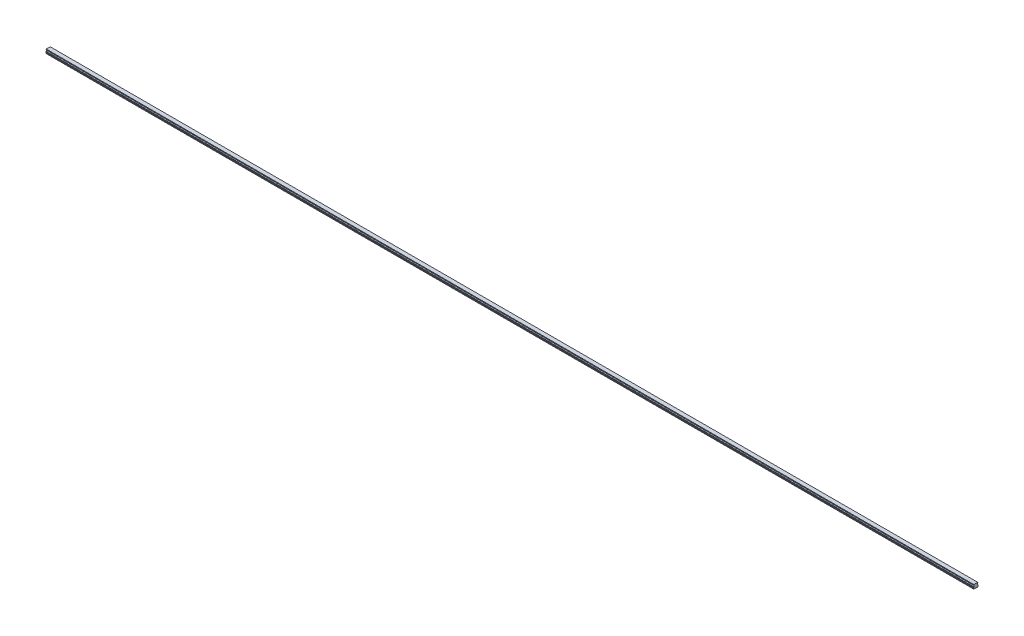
from build123d import *

# Parameters (mm, degrees)
BOSS_EXTRUDE1_DEPTH        = 3120
SKETCH3_R                  = 2.5
SKETCH3_R_2                = 2.1
CUT_EXTRUDE3_DEPTH         = 7
SKETCH3_2_R                = 2.1
CUT_EXTRUDE4_DEPTH         = 9.5
CHAMFER1_SIZE              = 0.4
LPATTERN2_COUNT            = 52
LPATTERN2_PITCH            = 60
CHAMFER1_OF_LPATTERN2_SIZE = 0.4


with BuildPart() as part:
    # Sketch1 → Boss-Extrude1 (new body)
    with BuildSketch(Plane(origin=(0, 0, 0), x_dir=(0, 0, -1), z_dir=(1, 0, 0))):
        with BuildLine():
            Line((6.59, 14), (-6.59, 14))
            Line((-6.59, 14), (-6.59, 13.15))
            Line((-6.59, 13.15), (-6.96, 12.356532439))
            Line((-6.96, 12.356532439), (-6.96, 11.435174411))
            ThreePointArc((-6.96, 11.435174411), (-5.25, 9.5), (-6.96, 7.564825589))
            Line((-6.96, 7.564825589), (-6.96, 6.643467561))
            Line((-6.96, 6.643467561), (-6.59, 5.85))
            Line((-6.59, 5.85), (-7.032116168, 4.2))
            Line((-7.032116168, 4.2), (-7.5, 3.929867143))
            Line((-7.5, 3.929867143), (-7.5, 1.4))
            Line((-7.5, 1.4), (-6.1, 0))
            Line((-6.1, 0), (-3.65, 0))
            Line((-3.65, 0), (-3.25, 0.4))
            Line((-3.25, 0.4), (3.25, 0.4))
            Line((3.25, 0.4), (3.65, 0))
            Line((3.65, 0), (6.1, 0))
            Line((6.1, 0), (7.5, 1.4))
            Line((7.5, 1.4), (7.5, 3.929867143))
            Line((7.5, 3.929867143), (7.032116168, 4.2))
            Line((7.032116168, 4.2), (6.59, 5.85))
            Line((6.59, 5.85), (6.96, 6.643467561))
            Line((6.96, 6.643467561), (6.96, 7.564825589))
            ThreePointArc((6.96, 7.564825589), (5.25, 9.5), (6.96, 11.435174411))
            Line((6.96, 11.435174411), (6.96, 12.356532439))
            Line((6.96, 12.356532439), (6.59, 13.15))
            Line((6.59, 13.15), (6.59, 14))
        make_face()
    extrude(amount=BOSS_EXTRUDE1_DEPTH)

    # Sketch3 → Cut-Extrude3 (cut)
    with BuildSketch(Plane.XZ):
        with Locations(Location((30, 0, 0), (0, 0, 270))):
            Circle(SKETCH3_R)
        with Locations(Location((30, 0, 0), (0, 0, 270))):
            Circle(SKETCH3_R_2, mode=Mode.SUBTRACT)
    cut_extrude3 = extrude(amount=-CUT_EXTRUDE3_DEPTH, mode=Mode.SUBTRACT)

    # Sketch3_2 → Cut-Extrude4 (cut)
    with BuildSketch(Plane.XZ):
        with Locations(Location((30, 0, 0), (0, 0, 270))):
            Circle(SKETCH3_2_R)
    cut_extrude4 = extrude(amount=-CUT_EXTRUDE4_DEPTH, mode=Mode.SUBTRACT)

    # Cut-Extrude5 cone 1 section (on through the dimple's axis) → Cut-Extrude5 (revolve, cut)
    with BuildSketch(Plane(origin=(30, 9.5, 0), x_dir=(0, 0, -1), z_dir=(1, 0, 0))):
        Polygon((0, 0), (2.1, 0), (0, 1.212435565), align=None)
    revolve(axis=Axis((30, 9.5, 0), (0, 1, 0)), mode=Mode.SUBTRACT)

    # Chamfer1
    chamfer1_edges = [part.edges().sort_by_distance(p)[0] for p in [
        (30, 0.4, 2.5),
    ]]
    chamfer(chamfer1_edges, length=CHAMFER1_SIZE)

    # LPattern2: Cut-Extrude3, Cut-Extrude4 ×52
    with Locations(*[(i * LPATTERN2_PITCH, 0, 0) for i in range(1, LPATTERN2_COUNT)]):
        add(cut_extrude3, mode=Mode.SUBTRACT)
        add(cut_extrude4, mode=Mode.SUBTRACT)

    # Chamfer1 of LPattern2
    chamfer1_of_lpattern2_edges = [part.edges().sort_by_distance(p)[0] for p in [
        (90, 0.4, 2.5),
        (150, 0.4, 2.5),
        (210, 0.4, 2.5),
        (270, 0.4, 2.5),
        (330, 0.4, 2.5),
        (390, 0.4, 2.5),
        (450, 0.4, 2.5),
        (510, 0.4, 2.5),
        (570, 0.4, 2.5),
        (630, 0.4, 2.5),
        (690, 0.4, 2.5),
        (750, 0.4, 2.5),
        (810, 0.4, 2.5),
        (870, 0.4, 2.5),
        (930, 0.4, 2.5),
        (990, 0.4, 2.5),
        (1050, 0.4, 2.5),
        (1110, 0.4, 2.5),
        (1170, 0.4, 2.5),
        (1230, 0.4, 2.5),
        (1290, 0.4, 2.5),
        (1350, 0.4, 2.5),
        (1410, 0.4, 2.5),
        (1470, 0.4, 2.5),
        (1530, 0.4, 2.5),
        (1590, 0.4, 2.5),
        (1650, 0.4, 2.5),
        (1710, 0.4, 2.5),
        (1770, 0.4, 2.5),
        (1830, 0.4, 2.5),
        (1890, 0.4, 2.5),
        (1950, 0.4, 2.5),
        (2010, 0.4, 2.5),
        (2070, 0.4, 2.5),
        (2130, 0.4, 2.5),
        (2190, 0.4, 2.5),
        (2250, 0.4, 2.5),
        (2310, 0.4, 2.5),
        (2370, 0.4, 2.5),
        (2430, 0.4, 2.5),
        (2490, 0.4, 2.5),
        (2550, 0.4, 2.5),
        (2610, 0.4, 2.5),
        (2670, 0.4, 2.5),
        (2730, 0.4, 2.5),
        (2790, 0.4, 2.5),
        (2850, 0.4, 2.5),
        (2910, 0.4, 2.5),
        (2970, 0.4, 2.5),
        (3030, 0.4, 2.5),
        (3090, 0.4, 2.5),
    ]]
    chamfer(chamfer1_of_lpattern2_edges, length=CHAMFER1_OF_LPATTERN2_SIZE)


solid = part.part
